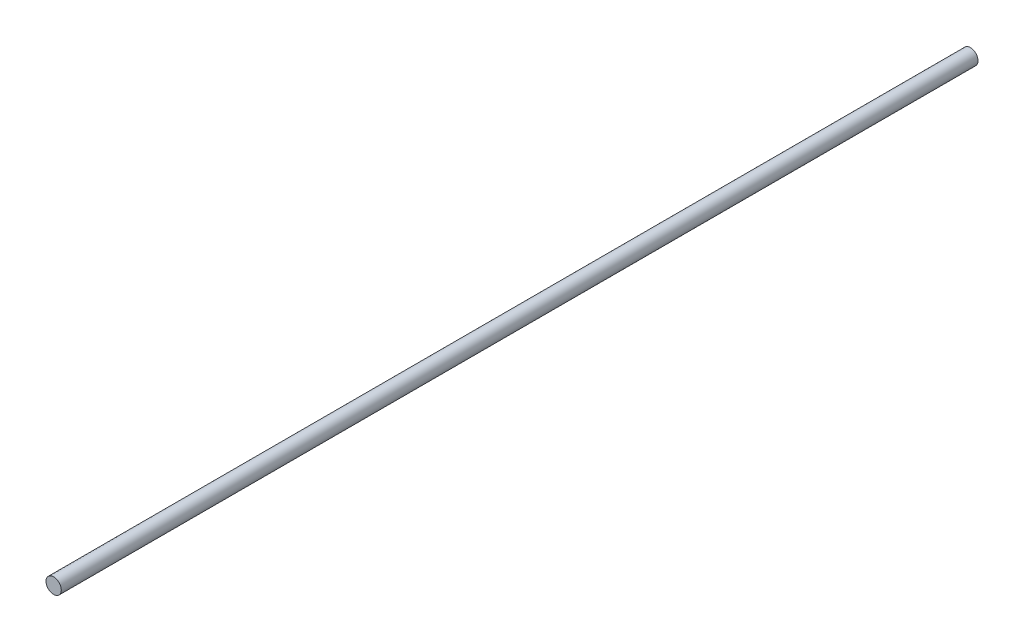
from build123d import *

# Parameters (mm, degrees)
SKETCH1_R           = 1.5
BOSS_EXTRUDE1_DEPTH = 90


with BuildPart() as part:
    # Sketch1 → Boss-Extrude1 (new, symmetric)
    with BuildSketch(Plane.XY):
        with Locations(Location((0, 0, 0), (0, 0, 180))):
            Circle(SKETCH1_R)
    extrude(amount=BOSS_EXTRUDE1_DEPTH, both=True)


solid = part.part
